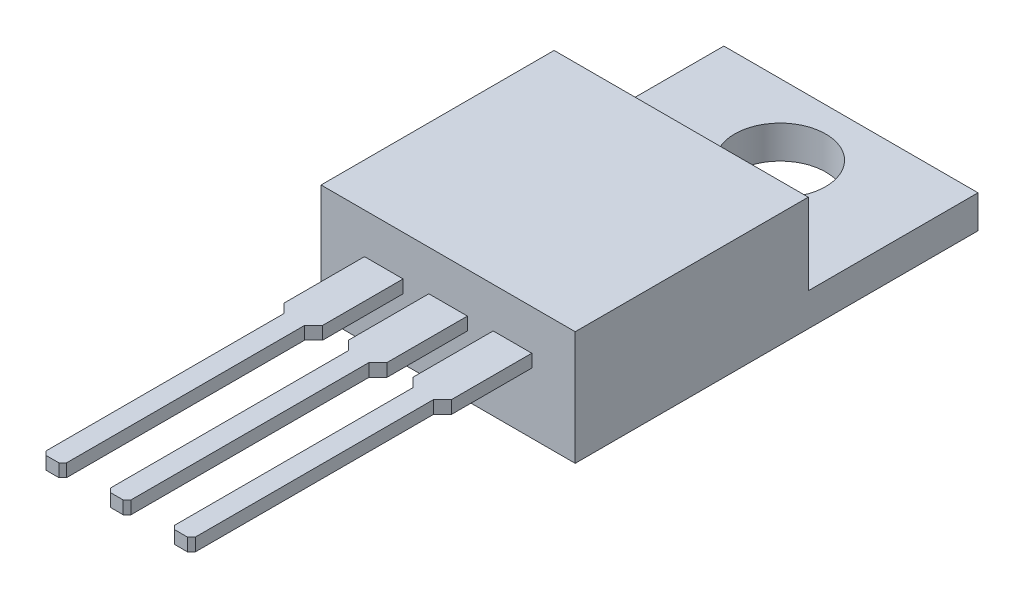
from build123d import *

# Parameters (mm, degrees)
SKETCH1_W          = 10.033
SKETCH1_H          = 15.9004
EXTRUDE1_DEPTH     = 1.30048
SKETCH2_R          = 1.79959
CUT_EXTRUDE1_DEPTH = 15.093766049
SKETCH3_W          = 10.033
SKETCH3_H          = 9.19988
EXTRUDE2_DEPTH     = 3.2004
SKETCH4_W          = 1.524
SKETCH4_H          = 0.508
EXTRUDE3_DEPTH     = 13.081
CUT_EXTRUDE2_DEPTH = 27.82169644


with BuildPart() as part:
    # Sketch1 → Extrude1 (new body)
    with BuildSketch(Plane(origin=(0, 0, 0), x_dir=(1, 0, 0), z_dir=(0, 1, 0))):
        with Locations((0, -5.1562)):
            Rectangle(SKETCH1_W, SKETCH1_H)
    extrude(amount=EXTRUDE1_DEPTH)

    # Sketch2 → Cut-Extrude1 (cut, through all)
    with BuildSketch(Plane(origin=(0, 1.30048, 0), x_dir=(-1, 0, 0), z_dir=(0, 1, 0))):
        with Locations(Location((0, 0, 0), (0, 0, 90))):
            Circle(SKETCH2_R)
    extrude(amount=-CUT_EXTRUDE1_DEPTH, mode=Mode.SUBTRACT)

    # Sketch3 → Extrude2 (add)
    with BuildSketch(Plane(origin=(0, 1.30048, 0), x_dir=(-1, 0, 0), z_dir=(0, 1, 0))):
        with Locations((0, 8.50646)):
            Rectangle(SKETCH3_W, SKETCH3_H)
    extrude(amount=EXTRUDE2_DEPTH)

    # Sketch4 → Extrude3 (add)
    with BuildSketch(Plane.XY.offset(13.1064)):
        with Locations((-2.54, 2.6543)):
            Rectangle(SKETCH4_W, SKETCH4_H)
        with Locations((0, 2.6543)):
            Rectangle(SKETCH4_W, SKETCH4_H)
        with Locations((2.54, 2.6543)):
            Rectangle(SKETCH4_W, SKETCH4_H)
    extrude(amount=EXTRUDE3_DEPTH)

    # Sketch5 → Cut-Extrude2 (cut, through all)
    with BuildSketch(Plane(origin=(0, 2.9083, 0), x_dir=(-1, 0, 0), z_dir=(0, 1, 0))):
        Polygon((-3.302, 16.2814), (-2.9464, 16.637), (-2.9464, 26.035), (-2.794, 26.1874), (-2.286, 26.1874), (-2.1336, 26.035), (-2.1336, 16.637), (-1.778, 16.2814), (-0.762, 16.2814), (-0.4064, 16.637), (-0.4064, 26.035), (-0.254, 26.1874), (0.254, 26.1874), (0.4064, 26.035), (0.4064, 16.637), (0.762, 16.2814), (1.778, 16.2814), (2.1336, 16.637), (2.1336, 26.035), (2.286, 26.1874), (2.794, 26.1874), (2.9464, 26.035), (2.9464, 16.637), (3.302, 16.2814), (3.556, 16.2814), (3.556, 26.4414), (-3.556, 26.4414), (-3.556, 16.2814), align=None)
    extrude(amount=-CUT_EXTRUDE2_DEPTH, mode=Mode.SUBTRACT)


solid = part.part
